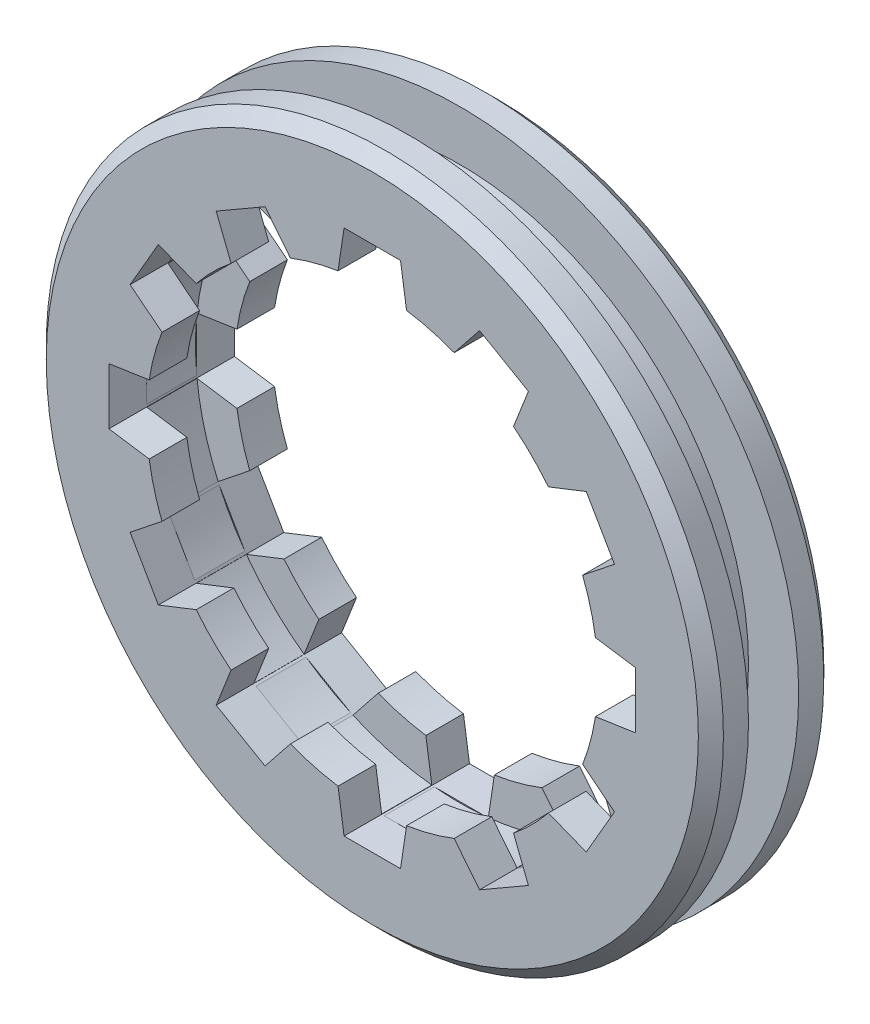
from build123d import *

# Parameters (mm, degrees)
ESQUISSE1_R                  = 27
ESQUISSE1_R_2                = 18
BASE_EXTRUSION_DEPTH         = 3
ESQUISSE2_R                  = 23
ESQUISSE2_R_2                = 21.1
BOSS_EXTRU_1_DEPTH           = 4
ESQUISSE3_R                  = 27
ESQUISSE3_R_2                = 18
BOSS_EXTRU_2_DEPTH           = 3
CHANFREIN1_SIZE              = 1
ENL_V_MAT_EXTRU_1_DEPTH      = 40.471508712
R_P_TITION_CIRCULAIRE1_COUNT = 12


with BuildPart() as part:
    # Esquisse1 → Base-Extrusion (new body)
    with BuildSketch(Plane.XY):
        Circle(ESQUISSE1_R)
        Circle(ESQUISSE1_R_2, mode=Mode.SUBTRACT)
    extrude(amount=BASE_EXTRUSION_DEPTH)

    # Esquisse2 → Boss.-Extru.1 (add)
    with BuildSketch(Plane.XY.offset(3)):
        Circle(ESQUISSE2_R)
        Circle(ESQUISSE2_R_2, mode=Mode.SUBTRACT)
    extrude(amount=BOSS_EXTRU_1_DEPTH)

    # Esquisse3 → Boss.-Extru.2 (add)
    with BuildSketch(Plane.XY.offset(7)):
        Circle(ESQUISSE3_R)
        Circle(ESQUISSE3_R_2, mode=Mode.SUBTRACT)
    extrude(amount=BOSS_EXTRU_2_DEPTH)

    # Chanfrein1
    chanfrein1_edges = [part.edges().sort_by_distance(p)[0] for p in [
        (-27, 0, 10),
        (-27, 0, 0),
    ]]
    chamfer(chanfrein1_edges, length=CHANFREIN1_SIZE)

    # Esquisse4 → Enl_v. mat.-Extru.1 (cut, through all)
    with BuildSketch(Plane.XY.offset(10)):
        Polygon((-2.25, 21), (-3, 16), (3, 16), (2.25, 21), align=None)
    enl_v_mat_extru_1 = extrude(amount=-ENL_V_MAT_EXTRU_1_DEPTH, mode=Mode.SUBTRACT)

    # R_p_tition circulaire1: Enl_v. mat.-Extru.1 ×12 about axis
    r_p_tition_circulaire1_axis = Axis((0, 0, 60), (0, 0, -1))
    for i in range(1, R_P_TITION_CIRCULAIRE1_COUNT):
        add(enl_v_mat_extru_1.rotate(r_p_tition_circulaire1_axis, i * 360 / R_P_TITION_CIRCULAIRE1_COUNT), mode=Mode.SUBTRACT)


solid = part.part
